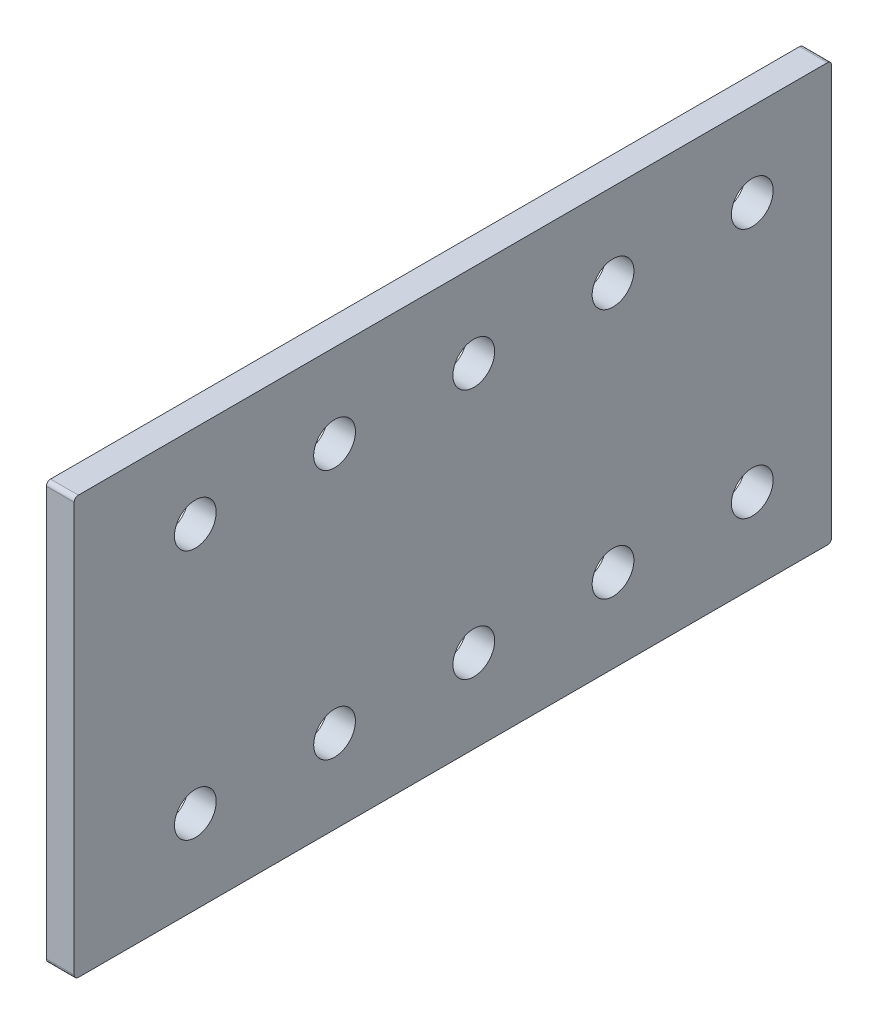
from build123d import *

# Parameters (mm, degrees)
SZKIC13_W                   = 544
SZKIC13_H                   = 300
SZKIC13_R                   = 15
DODANIE_WYCI_GNI_CIE1_DEPTH = 20
ZAOKR_GLENIE1_R             = 3


with BuildPart() as part:
    # Szkic13 → Dodanie-wyci_gni_cie1 (new body)
    with BuildSketch(Plane.ZY):
        with Locations((9, 0)):
            Rectangle(SZKIC13_W, SZKIC13_H)
        with Locations((-6, -90)):
            Circle(SZKIC13_R, mode=Mode.SUBTRACT)
        with Locations((194, -90)):
            Circle(SZKIC13_R, mode=Mode.SUBTRACT)
        with Locations((94, -90)):
            Circle(SZKIC13_R, mode=Mode.SUBTRACT)
        with Locations(Location((94, 90, 0), (0, 0, 180))):
            Circle(SZKIC13_R, mode=Mode.SUBTRACT)
        with Locations(Location((194, 90, 0), (0, 0, 180))):
            Circle(SZKIC13_R, mode=Mode.SUBTRACT)
        with Locations(Location((-6, 90, 0), (0, 0, 180))):
            Circle(SZKIC13_R, mode=Mode.SUBTRACT)
        with Locations((-206, -90)):
            Circle(SZKIC13_R, mode=Mode.SUBTRACT)
        with Locations((-106, -90)):
            Circle(SZKIC13_R, mode=Mode.SUBTRACT)
        with Locations(Location((-106, 90, 0), (0, 0, 180))):
            Circle(SZKIC13_R, mode=Mode.SUBTRACT)
        with Locations(Location((-206, 90, 0), (0, 0, 180))):
            Circle(SZKIC13_R, mode=Mode.SUBTRACT)
    extrude(amount=DODANIE_WYCI_GNI_CIE1_DEPTH)

    # Zaokr_glenie1
    zaokr_glenie1_edges = [part.edges().sort_by_distance(p)[0] for p in [
        (-10, 150, -263),
        (-10, 150, 281),
        (-10, -150, 281),
        (-10, -150, -263),
    ]]
    fillet(zaokr_glenie1_edges, radius=ZAOKR_GLENIE1_R)


solid = part.part
